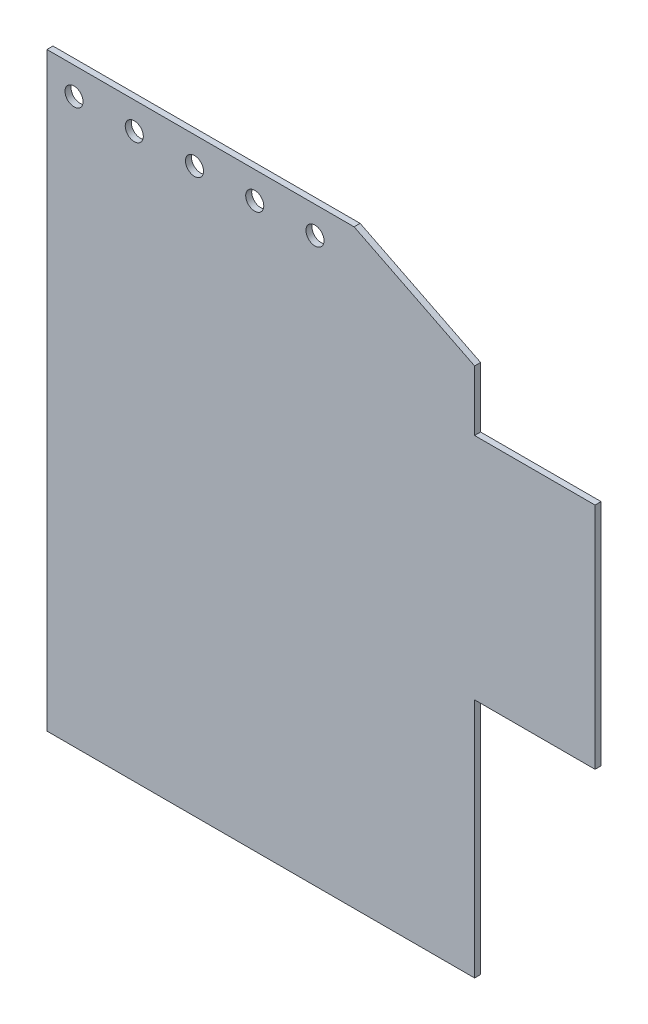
from build123d import *

# Parameters (mm, degrees)
SKETCH_3_R      = 1.5
EXTRUDE_1_DEPTH = 1


with BuildPart() as part:
    # Sketch 3 → Extrude 1 (new body)
    with BuildSketch(Plane.XY):
        Polygon((-14.935727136, 46.178177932), (-14.935727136, -51.821822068), (56.064272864, -51.821822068), (56.064272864, -11.821822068), (76.064272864, -11.821822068), (76.064272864, 26.178177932), (56.064272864, 26.178177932), (56.064272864, 36.178177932), (36.064272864, 46.178177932), align=None)
        with Locations((-10.435727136, 41.678177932)):
            Circle(SKETCH_3_R, mode=Mode.SUBTRACT)
        with Locations((-0.435727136, 41.678177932)):
            Circle(SKETCH_3_R, mode=Mode.SUBTRACT)
        with Locations((9.564272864, 41.678177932)):
            Circle(SKETCH_3_R, mode=Mode.SUBTRACT)
        with Locations((19.564272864, 41.678177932)):
            Circle(SKETCH_3_R, mode=Mode.SUBTRACT)
        with Locations((29.564272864, 41.678177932)):
            Circle(SKETCH_3_R, mode=Mode.SUBTRACT)
    extrude(amount=EXTRUDE_1_DEPTH)


solid = part.part
